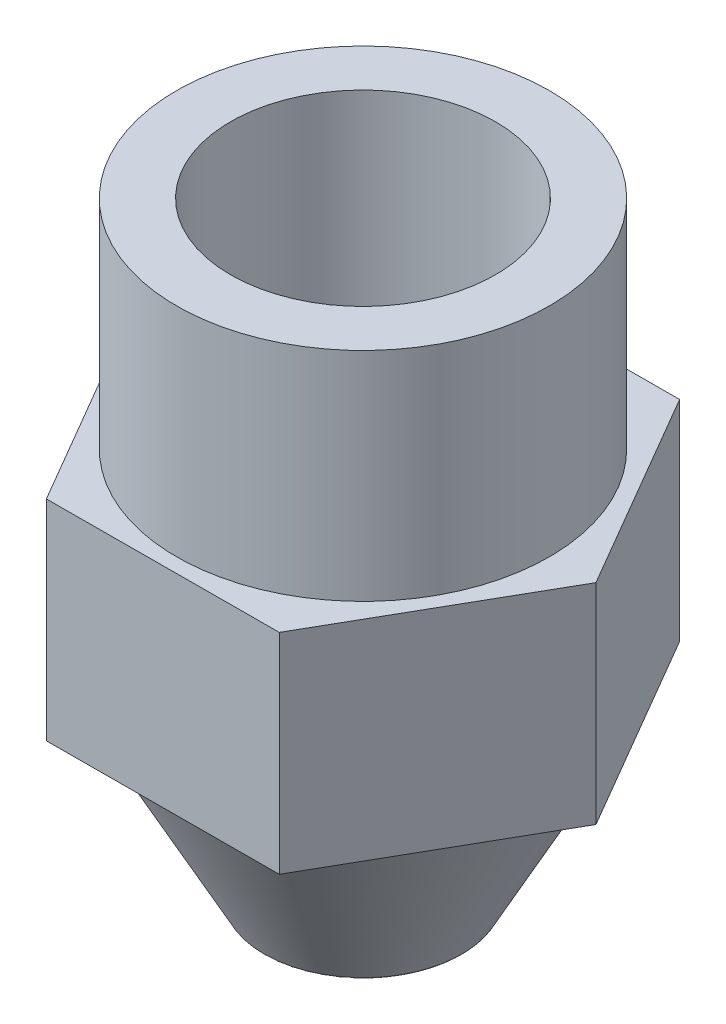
ISO-10303-21;
HEADER;
FILE_DESCRIPTION(('STEP AP214'),'2;1');
FILE_NAME('part.step','',(''),(''),'','','');
FILE_SCHEMA(('AUTOMOTIVE_DESIGN { 1 0 10303 214 1 1 1 1 }'));
ENDSEC;
DATA;
#1=APPLICATION_CONTEXT('core data for automotive mechanical design processes');
#2=APPLICATION_PROTOCOL_DEFINITION('international standard','automotive_design',2000,#1);
#3=PRODUCT_CONTEXT('',#1,'mechanical');
#4=PRODUCT('Part','Part','',(#3));
#5=PRODUCT_RELATED_PRODUCT_CATEGORY('part','',(#4));
#6=PRODUCT_DEFINITION_FORMATION('','',#4);
#7=PRODUCT_DEFINITION_CONTEXT('part definition',#1,'design');
#8=PRODUCT_DEFINITION('design','',#6,#7);
#9=PRODUCT_DEFINITION_SHAPE('','',#8);
#10=(LENGTH_UNIT() NAMED_UNIT(*) SI_UNIT(.MILLI.,.METRE.));
#11=(NAMED_UNIT(*) PLANE_ANGLE_UNIT() SI_UNIT($,.RADIAN.));
#12=(NAMED_UNIT(*) SI_UNIT($,.STERADIAN.) SOLID_ANGLE_UNIT());
#13=UNCERTAINTY_MEASURE_WITH_UNIT(LENGTH_MEASURE(1.E-05),#10,'distance_accuracy_value','');
#14=(GEOMETRIC_REPRESENTATION_CONTEXT(3) GLOBAL_UNCERTAINTY_ASSIGNED_CONTEXT((#13)) GLOBAL_UNIT_ASSIGNED_CONTEXT((#10,
#11,#12)) REPRESENTATION_CONTEXT('',''));
#15=CARTESIAN_POINT('',(0.,0.,0.));
#16=DIRECTION('',(0.,0.,1.));
#17=DIRECTION('',(1.,0.,0.));
#18=AXIS2_PLACEMENT_3D('',#15,#16,#17);
#19=CARTESIAN_POINT('',(0.,-7.5,0.));
#20=DIRECTION('',(0.,1.,0.));
#21=DIRECTION('',(0.,0.,1.));
#22=AXIS2_PLACEMENT_3D('',#19,#20,#21);
#23=CYLINDRICAL_SURFACE('',#22,4.575);
#24=CARTESIAN_POINT('',(0.,0.,0.));
#25=DIRECTION('',(0.,-1.,0.));
#26=DIRECTION('',(0.,0.,-1.));
#27=AXIS2_PLACEMENT_3D('',#24,#25,#26);
#28=CIRCLE('',#27,4.575);
#29=CARTESIAN_POINT('',(0.,0.,-4.575));
#30=VERTEX_POINT('',#29);
#31=EDGE_CURVE('E11',#30,#30,#28,.T.);
#32=ORIENTED_EDGE('',*,*,#31,.F.);
#33=EDGE_LOOP('',(#32));
#34=FACE_BOUND('',#33,.T.);
#35=CARTESIAN_POINT('',(0.,-14.73,0.));
#36=DIRECTION('',(0.,-1.,0.));
#37=DIRECTION('',(0.,0.,-1.));
#38=AXIS2_PLACEMENT_3D('',#35,#36,#37);
#39=CIRCLE('',#38,4.575);
#40=CARTESIAN_POINT('',(0.,-14.73,-4.575));
#41=VERTEX_POINT('',#40);
#42=EDGE_CURVE('E26',#41,#41,#39,.T.);
#43=ORIENTED_EDGE('',*,*,#42,.T.);
#44=EDGE_LOOP('',(#43));
#45=FACE_BOUND('',#44,.T.);
#46=ADVANCED_FACE('F19',(#34,#45),#23,.F.);
#47=CARTESIAN_POINT('',(0.,-7.5,0.));
#48=DIRECTION('',(0.,1.,0.));
#49=DIRECTION('',(0.,0.,1.));
#50=AXIS2_PLACEMENT_3D('',#47,#48,#49);
#51=CYLINDRICAL_SURFACE('',#50,6.435);
#52=CARTESIAN_POINT('',(0.,-7.5,0.));
#53=DIRECTION('',(0.,-1.,0.));
#54=DIRECTION('',(0.,0.,-1.));
#55=AXIS2_PLACEMENT_3D('',#52,#53,#54);
#56=CIRCLE('',#55,6.435);
#57=CARTESIAN_POINT('',(0.,-7.5,-6.435));
#58=VERTEX_POINT('',#57);
#59=EDGE_CURVE('E128',#58,#58,#56,.T.);
#60=ORIENTED_EDGE('',*,*,#59,.F.);
#61=EDGE_LOOP('',(#60));
#62=FACE_BOUND('',#61,.T.);
#63=CARTESIAN_POINT('',(0.,0.,0.));
#64=DIRECTION('',(0.,-1.,0.));
#65=DIRECTION('',(0.,0.,-1.));
#66=AXIS2_PLACEMENT_3D('',#63,#64,#65);
#67=CIRCLE('',#66,6.435);
#68=CARTESIAN_POINT('',(0.,0.,-6.435));
#69=VERTEX_POINT('',#68);
#70=EDGE_CURVE('E125',#69,#69,#67,.T.);
#71=ORIENTED_EDGE('',*,*,#70,.T.);
#72=EDGE_LOOP('',(#71));
#73=FACE_BOUND('',#72,.T.);
#74=ADVANCED_FACE('F152',(#62,#73),#51,.T.);
#75=CARTESIAN_POINT('',(0.,0.,0.));
#76=DIRECTION('',(0.,-1.,0.));
#77=DIRECTION('',(1.,0.,0.));
#78=AXIS2_PLACEMENT_3D('',#75,#76,#77);
#79=PLANE('',#78);
#80=ORIENTED_EDGE('',*,*,#31,.T.);
#81=EDGE_LOOP('',(#80));
#82=FACE_BOUND('',#81,.T.);
#83=ORIENTED_EDGE('',*,*,#70,.F.);
#84=EDGE_LOOP('',(#83));
#85=FACE_BOUND('',#84,.T.);
#86=ADVANCED_FACE('F157',(#82,#85),#79,.F.);
#87=CARTESIAN_POINT('',(-0.0269826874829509,-14.73,-6.93494750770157));
#88=DIRECTION('',(0.00389079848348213,0.,0.999992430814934));
#89=DIRECTION('',(0.999992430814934,0.,-0.00389079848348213));
#90=AXIS2_PLACEMENT_3D('',#87,#88,#89);
#91=PLANE('',#90);
#92=DIRECTION('',(0.999992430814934,0.,-0.00389079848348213));
#93=VECTOR('',#92,1.);
#94=CARTESIAN_POINT('',(-0.0269826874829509,-7.5,-6.93494750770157));
#95=LINE('',#94,#93);
#96=CARTESIAN_POINT('',(-4.03087649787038,-7.5,-6.91936904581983));
#97=VERTEX_POINT('',#96);
#98=CARTESIAN_POINT('',(3.97691112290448,-7.5,-6.95052596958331));
#99=VERTEX_POINT('',#98);
#100=EDGE_CURVE('E33',#97,#99,#95,.T.);
#101=ORIENTED_EDGE('',*,*,#100,.T.);
#102=DIRECTION('',(0.,1.,0.));
#103=VECTOR('',#102,1.);
#104=CARTESIAN_POINT('',(3.97691112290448,-14.73,-6.95052596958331));
#105=LINE('',#104,#103);
#106=CARTESIAN_POINT('',(3.97691112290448,-14.73,-6.95052596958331));
#107=VERTEX_POINT('',#106);
#108=EDGE_CURVE('E37',#107,#99,#105,.T.);
#109=ORIENTED_EDGE('',*,*,#108,.F.);
#110=DIRECTION('',(0.999992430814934,0.,-0.00389079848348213));
#111=VECTOR('',#110,1.);
#112=CARTESIAN_POINT('',(-0.0269826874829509,-14.73,-6.93494750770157));
#113=LINE('',#112,#111);
#114=CARTESIAN_POINT('',(-4.03087649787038,-14.73,-6.91936904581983));
#115=VERTEX_POINT('',#114);
#116=EDGE_CURVE('E121',#115,#107,#113,.T.);
#117=ORIENTED_EDGE('',*,*,#116,.F.);
#118=DIRECTION('',(0.,1.,0.));
#119=VECTOR('',#118,1.);
#120=CARTESIAN_POINT('',(-4.03087649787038,-14.73,-6.91936904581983));
#121=LINE('',#120,#119);
#122=EDGE_CURVE('E86',#115,#97,#121,.T.);
#123=ORIENTED_EDGE('',*,*,#122,.T.);
#124=EDGE_LOOP('',(#101,#109,#117,#123));
#125=FACE_BOUND('',#124,.T.);
#126=ADVANCED_FACE('F163',(#125),#91,.F.);
#127=CARTESIAN_POINT('',(5.99234937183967,-14.73,-3.4908414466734));
#128=DIRECTION('',(-0.864073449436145,0.,0.503365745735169));
#129=DIRECTION('',(0.503365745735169,0.,0.864073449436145));
#130=AXIS2_PLACEMENT_3D('',#127,#128,#129);
#131=PLANE('',#130);
#132=DIRECTION('',(0.503365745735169,0.,0.864073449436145));
#133=VECTOR('',#132,1.);
#134=CARTESIAN_POINT('',(5.99234937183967,-7.5,-3.4908414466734));
#135=LINE('',#134,#133);
#136=CARTESIAN_POINT('',(8.00778762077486,-7.5,-0.0311569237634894));
#137=VERTEX_POINT('',#136);
#138=EDGE_CURVE('E118',#99,#137,#135,.T.);
#139=ORIENTED_EDGE('',*,*,#138,.T.);
#140=DIRECTION('',(0.,1.,0.));
#141=VECTOR('',#140,1.);
#142=CARTESIAN_POINT('',(8.00778762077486,-14.73,-0.0311569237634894));
#143=LINE('',#142,#141);
#144=CARTESIAN_POINT('',(8.00778762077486,-14.73,-0.0311569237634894));
#145=VERTEX_POINT('',#144);
#146=EDGE_CURVE('E115',#145,#137,#143,.T.);
#147=ORIENTED_EDGE('',*,*,#146,.F.);
#148=DIRECTION('',(0.503365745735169,0.,0.864073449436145));
#149=VECTOR('',#148,1.);
#150=CARTESIAN_POINT('',(5.99234937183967,-14.73,-3.4908414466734));
#151=LINE('',#150,#149);
#152=EDGE_CURVE('E112',#107,#145,#151,.T.);
#153=ORIENTED_EDGE('',*,*,#152,.F.);
#154=ORIENTED_EDGE('',*,*,#108,.T.);
#155=EDGE_LOOP('',(#139,#147,#153,#154));
#156=FACE_BOUND('',#155,.T.);
#157=ADVANCED_FACE('F170',(#156),#131,.F.);
#158=CARTESIAN_POINT('',(6.01933205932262,-14.73,3.44410606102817));
#159=DIRECTION('',(-0.867964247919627,0.,-0.496626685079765));
#160=DIRECTION('',(-0.496626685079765,0.,0.867964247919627));
#161=AXIS2_PLACEMENT_3D('',#158,#159,#160);
#162=PLANE('',#161);
#163=DIRECTION('',(-0.496626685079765,0.,0.867964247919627));
#164=VECTOR('',#163,1.);
#165=CARTESIAN_POINT('',(6.01933205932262,-7.5,3.44410606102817));
#166=LINE('',#165,#164);
#167=CARTESIAN_POINT('',(4.03087649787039,-7.5,6.91936904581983));
#168=VERTEX_POINT('',#167);
#169=EDGE_CURVE('E110',#137,#168,#166,.T.);
#170=ORIENTED_EDGE('',*,*,#169,.T.);
#171=DIRECTION('',(0.,1.,0.));
#172=VECTOR('',#171,1.);
#173=CARTESIAN_POINT('',(4.03087649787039,-14.73,6.91936904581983));
#174=LINE('',#173,#172);
#175=CARTESIAN_POINT('',(4.03087649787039,-14.73,6.91936904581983));
#176=VERTEX_POINT('',#175);
#177=EDGE_CURVE('E107',#176,#168,#174,.T.);
#178=ORIENTED_EDGE('',*,*,#177,.F.);
#179=DIRECTION('',(-0.496626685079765,0.,0.867964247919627));
#180=VECTOR('',#179,1.);
#181=CARTESIAN_POINT('',(6.01933205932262,-14.73,3.44410606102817));
#182=LINE('',#181,#180);
#183=EDGE_CURVE('E105',#145,#176,#182,.T.);
#184=ORIENTED_EDGE('',*,*,#183,.F.);
#185=ORIENTED_EDGE('',*,*,#146,.T.);
#186=EDGE_LOOP('',(#170,#178,#184,#185));
#187=FACE_BOUND('',#186,.T.);
#188=ADVANCED_FACE('F175',(#187),#162,.F.);
#189=CARTESIAN_POINT('',(0.0269826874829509,-14.73,6.93494750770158));
#190=DIRECTION('',(-0.00389079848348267,0.,-0.999992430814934));
#191=DIRECTION('',(-0.999992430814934,0.,0.00389079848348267));
#192=AXIS2_PLACEMENT_3D('',#189,#190,#191);
#193=PLANE('',#192);
#194=DIRECTION('',(-0.999992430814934,0.,0.00389079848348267));
#195=VECTOR('',#194,1.);
#196=CARTESIAN_POINT('',(0.0269826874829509,-7.5,6.93494750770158));
#197=LINE('',#196,#195);
#198=CARTESIAN_POINT('',(-3.97691112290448,-7.5,6.95052596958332));
#199=VERTEX_POINT('',#198);
#200=EDGE_CURVE('E103',#168,#199,#197,.T.);
#201=ORIENTED_EDGE('',*,*,#200,.T.);
#202=DIRECTION('',(0.,1.,0.));
#203=VECTOR('',#202,1.);
#204=CARTESIAN_POINT('',(-3.97691112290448,-14.73,6.95052596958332));
#205=LINE('',#204,#203);
#206=CARTESIAN_POINT('',(-3.97691112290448,-14.73,6.95052596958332));
#207=VERTEX_POINT('',#206);
#208=EDGE_CURVE('E101',#207,#199,#205,.T.);
#209=ORIENTED_EDGE('',*,*,#208,.F.);
#210=DIRECTION('',(-0.999992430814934,0.,0.00389079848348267));
#211=VECTOR('',#210,1.);
#212=CARTESIAN_POINT('',(0.0269826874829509,-14.73,6.93494750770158));
#213=LINE('',#212,#211);
#214=EDGE_CURVE('E95',#176,#207,#213,.T.);
#215=ORIENTED_EDGE('',*,*,#214,.F.);
#216=ORIENTED_EDGE('',*,*,#177,.T.);
#217=EDGE_LOOP('',(#201,#209,#215,#216));
#218=FACE_BOUND('',#217,.T.);
#219=ADVANCED_FACE('F179',(#218),#193,.F.);
#220=CARTESIAN_POINT('',(-5.99234937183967,-14.73,3.4908414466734));
#221=DIRECTION('',(0.864073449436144,0.,-0.503365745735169));
#222=DIRECTION('',(-0.503365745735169,0.,-0.864073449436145));
#223=AXIS2_PLACEMENT_3D('',#220,#221,#222);
#224=PLANE('',#223);
#225=DIRECTION('',(-0.503365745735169,0.,-0.864073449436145));
#226=VECTOR('',#225,1.);
#227=CARTESIAN_POINT('',(-5.99234937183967,-7.5,3.4908414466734));
#228=LINE('',#227,#226);
#229=CARTESIAN_POINT('',(-8.00778762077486,-7.5,0.0311569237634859));
#230=VERTEX_POINT('',#229);
#231=EDGE_CURVE('E77',#199,#230,#228,.T.);
#232=ORIENTED_EDGE('',*,*,#231,.T.);
#233=DIRECTION('',(0.,1.,0.));
#234=VECTOR('',#233,1.);
#235=CARTESIAN_POINT('',(-8.00778762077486,-14.73,0.0311569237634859));
#236=LINE('',#235,#234);
#237=CARTESIAN_POINT('',(-8.00778762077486,-14.73,0.0311569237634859));
#238=VERTEX_POINT('',#237);
#239=EDGE_CURVE('E69',#238,#230,#236,.T.);
#240=ORIENTED_EDGE('',*,*,#239,.F.);
#241=DIRECTION('',(-0.503365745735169,0.,-0.864073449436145));
#242=VECTOR('',#241,1.);
#243=CARTESIAN_POINT('',(-5.99234937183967,-14.73,3.4908414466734));
#244=LINE('',#243,#242);
#245=EDGE_CURVE('E74',#207,#238,#244,.T.);
#246=ORIENTED_EDGE('',*,*,#245,.F.);
#247=ORIENTED_EDGE('',*,*,#208,.T.);
#248=EDGE_LOOP('',(#232,#240,#246,#247));
#249=FACE_BOUND('',#248,.T.);
#250=ADVANCED_FACE('F71',(#249),#224,.F.);
#251=CARTESIAN_POINT('',(-6.01933205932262,-14.73,-3.44410606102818));
#252=DIRECTION('',(0.867964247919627,0.,0.496626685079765));
#253=DIRECTION('',(0.496626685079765,0.,-0.867964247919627));
#254=AXIS2_PLACEMENT_3D('',#251,#252,#253);
#255=PLANE('',#254);
#256=DIRECTION('',(0.496626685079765,0.,-0.867964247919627));
#257=VECTOR('',#256,1.);
#258=CARTESIAN_POINT('',(-6.01933205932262,-7.5,-3.44410606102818));
#259=LINE('',#258,#257);
#260=EDGE_CURVE('E89',#230,#97,#259,.T.);
#261=ORIENTED_EDGE('',*,*,#260,.T.);
#262=ORIENTED_EDGE('',*,*,#122,.F.);
#263=DIRECTION('',(0.496626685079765,0.,-0.867964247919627));
#264=VECTOR('',#263,1.);
#265=CARTESIAN_POINT('',(-6.01933205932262,-14.73,-3.44410606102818));
#266=LINE('',#265,#264);
#267=EDGE_CURVE('E84',#238,#115,#266,.T.);
#268=ORIENTED_EDGE('',*,*,#267,.F.);
#269=ORIENTED_EDGE('',*,*,#239,.T.);
#270=EDGE_LOOP('',(#261,#262,#268,#269));
#271=FACE_BOUND('',#270,.T.);
#272=ADVANCED_FACE('F85',(#271),#255,.F.);
#273=CARTESIAN_POINT('',(0.,-14.73,0.));
#274=DIRECTION('',(0.,-1.,0.));
#275=DIRECTION('',(1.,0.,0.));
#276=AXIS2_PLACEMENT_3D('',#273,#274,#275);
#277=PLANE('',#276);
#278=CARTESIAN_POINT('',(0.,-14.73,0.));
#279=DIRECTION('',(0.,1.,0.));
#280=DIRECTION('',(0.,0.,1.));
#281=AXIS2_PLACEMENT_3D('',#278,#279,#280);
#282=CIRCLE('',#281,6.72301731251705);
#283=CARTESIAN_POINT('',(0.,-14.73,6.72301731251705));
#284=VERTEX_POINT('',#283);
#285=EDGE_CURVE('E90',#284,#284,#282,.T.);
#286=ORIENTED_EDGE('',*,*,#285,.T.);
#287=EDGE_LOOP('',(#286));
#288=FACE_BOUND('',#287,.T.);
#289=ORIENTED_EDGE('',*,*,#116,.T.);
#290=ORIENTED_EDGE('',*,*,#152,.T.);
#291=ORIENTED_EDGE('',*,*,#183,.T.);
#292=ORIENTED_EDGE('',*,*,#214,.T.);
#293=ORIENTED_EDGE('',*,*,#245,.T.);
#294=ORIENTED_EDGE('',*,*,#267,.T.);
#295=EDGE_LOOP('',(#289,#290,#291,#292,#293,#294));
#296=FACE_BOUND('',#295,.T.);
#297=ADVANCED_FACE('F92',(#288,#296),#277,.T.);
#298=CARTESIAN_POINT('',(0.,-7.5,0.));
#299=DIRECTION('',(0.,-1.,0.));
#300=DIRECTION('',(1.,0.,0.));
#301=AXIS2_PLACEMENT_3D('',#298,#299,#300);
#302=PLANE('',#301);
#303=ORIENTED_EDGE('',*,*,#59,.T.);
#304=EDGE_LOOP('',(#303));
#305=FACE_BOUND('',#304,.T.);
#306=ORIENTED_EDGE('',*,*,#100,.F.);
#307=ORIENTED_EDGE('',*,*,#260,.F.);
#308=ORIENTED_EDGE('',*,*,#231,.F.);
#309=ORIENTED_EDGE('',*,*,#200,.F.);
#310=ORIENTED_EDGE('',*,*,#169,.F.);
#311=ORIENTED_EDGE('',*,*,#138,.F.);
#312=EDGE_LOOP('',(#306,#307,#308,#309,#310,#311));
#313=FACE_BOUND('',#312,.T.);
#314=ADVANCED_FACE('F137',(#305,#313),#302,.F.);
#315=CARTESIAN_POINT('',(4.97301731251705,-14.73,0.));
#316=DIRECTION('',(0.,1.,0.));
#317=DIRECTION('',(0.,0.,1.));
#318=AXIS2_PLACEMENT_3D('',#315,#316,#317);
#319=PLANE('',#318);
#320=CARTESIAN_POINT('',(0.,-14.73,0.));
#321=DIRECTION('',(0.,1.,0.));
#322=DIRECTION('',(0.,0.,1.));
#323=AXIS2_PLACEMENT_3D('',#320,#321,#322);
#324=CIRCLE('',#323,3.32301731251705);
#325=CARTESIAN_POINT('',(0.,-14.73,3.32301731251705));
#326=VERTEX_POINT('',#325);
#327=EDGE_CURVE('E195',#326,#326,#324,.F.);
#328=ORIENTED_EDGE('',*,*,#327,.T.);
#329=EDGE_LOOP('',(#328));
#330=FACE_BOUND('',#329,.T.);
#331=ORIENTED_EDGE('',*,*,#42,.F.);
#332=EDGE_LOOP('',(#331));
#333=FACE_BOUND('',#332,.T.);
#334=ADVANCED_FACE('F134',(#330,#333),#319,.T.);
#335=CARTESIAN_POINT('',(0.,-11.5643516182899,0.));
#336=DIRECTION('',(0.,1.,0.));
#337=DIRECTION('',(0.,0.,1.));
#338=AXIS2_PLACEMENT_3D('',#335,#336,#337);
#339=CYLINDRICAL_SURFACE('',#338,3.22301731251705);
#340=CARTESIAN_POINT('',(0.,-14.83,0.));
#341=DIRECTION('',(0.,1.,0.));
#342=DIRECTION('',(0.,0.,1.));
#343=AXIS2_PLACEMENT_3D('',#340,#341,#342);
#344=CIRCLE('',#343,3.22301731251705);
#345=CARTESIAN_POINT('',(0.,-14.83,3.22301731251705));
#346=VERTEX_POINT('',#345);
#347=EDGE_CURVE('E197',#346,#346,#344,.T.);
#348=ORIENTED_EDGE('',*,*,#347,.T.);
#349=EDGE_LOOP('',(#348));
#350=FACE_BOUND('',#349,.T.);
#351=CARTESIAN_POINT('',(0.,-20.8333596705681,0.));
#352=DIRECTION('',(0.,-1.,0.));
#353=DIRECTION('',(0.,0.,-1.));
#354=AXIS2_PLACEMENT_3D('',#351,#352,#353);
#355=CIRCLE('',#354,3.22301731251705);
#356=CARTESIAN_POINT('',(0.,-20.8333596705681,-3.22301731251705));
#357=VERTEX_POINT('',#356);
#358=EDGE_CURVE('E202',#357,#357,#355,.T.);
#359=ORIENTED_EDGE('',*,*,#358,.T.);
#360=EDGE_LOOP('',(#359));
#361=FACE_BOUND('',#360,.T.);
#362=ADVANCED_FACE('F136',(#350,#361),#339,.F.);
#363=CARTESIAN_POINT('',(0.,-14.73,0.));
#364=DIRECTION('',(0.,1.,0.));
#365=DIRECTION('',(0.,0.,1.));
#366=AXIS2_PLACEMENT_3D('',#363,#364,#365);
#367=CONICAL_SURFACE('',#366,6.72301731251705,0.493941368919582);
#368=CARTESIAN_POINT('',(0.,-20.8807696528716,0.));
#369=DIRECTION('',(0.,-1.,0.));
#370=DIRECTION('',(0.,0.,-1.));
#371=AXIS2_PLACEMENT_3D('',#368,#369,#370);
#372=CIRCLE('',#371,3.41106442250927);
#373=CARTESIAN_POINT('',(0.,-20.8807696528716,-3.41106442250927));
#374=VERTEX_POINT('',#373);
#375=EDGE_CURVE('E205',#374,#374,#372,.F.);
#376=ORIENTED_EDGE('',*,*,#375,.T.);
#377=EDGE_LOOP('',(#376));
#378=FACE_BOUND('',#377,.T.);
#379=ORIENTED_EDGE('',*,*,#285,.F.);
#380=EDGE_LOOP('',(#379));
#381=FACE_BOUND('',#380,.T.);
#382=ADVANCED_FACE('F145',(#378,#381),#367,.T.);
#383=CARTESIAN_POINT('',(0.,-20.8333596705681,0.));
#384=DIRECTION('',(0.,-1.,0.));
#385=DIRECTION('',(0.,0.,-1.));
#386=AXIS2_PLACEMENT_3D('',#383,#384,#385);
#387=TOROIDAL_SURFACE('',#386,3.32301731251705,0.1);
#388=ORIENTED_EDGE('',*,*,#358,.F.);
#389=EDGE_LOOP('',(#388));
#390=FACE_BOUND('',#389,.T.);
#391=ORIENTED_EDGE('',*,*,#375,.F.);
#392=EDGE_LOOP('',(#391));
#393=FACE_BOUND('',#392,.T.);
#394=ADVANCED_FACE('F210',(#390,#393),#387,.T.);
#395=CARTESIAN_POINT('',(0.,-14.83,0.));
#396=DIRECTION('',(0.,1.,0.));
#397=DIRECTION('',(0.,0.,1.));
#398=AXIS2_PLACEMENT_3D('',#395,#396,#397);
#399=TOROIDAL_SURFACE('',#398,3.32301731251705,0.1);
#400=ORIENTED_EDGE('',*,*,#327,.F.);
#401=EDGE_LOOP('',(#400));
#402=FACE_BOUND('',#401,.T.);
#403=ORIENTED_EDGE('',*,*,#347,.F.);
#404=EDGE_LOOP('',(#403));
#405=FACE_BOUND('',#404,.T.);
#406=ADVANCED_FACE('F212',(#402,#405),#399,.T.);
#407=CLOSED_SHELL('',(#46,#74,#86,#126,#157,#188,#219,#250,#272,#297,#314,#334,#362,#382,#394,#406));
#408=MANIFOLD_SOLID_BREP('B1',#407);
#409=ADVANCED_BREP_SHAPE_REPRESENTATION('',(#18,#408),#14);
#410=SHAPE_DEFINITION_REPRESENTATION(#9,#409);
ENDSEC;
END-ISO-10303-21;
